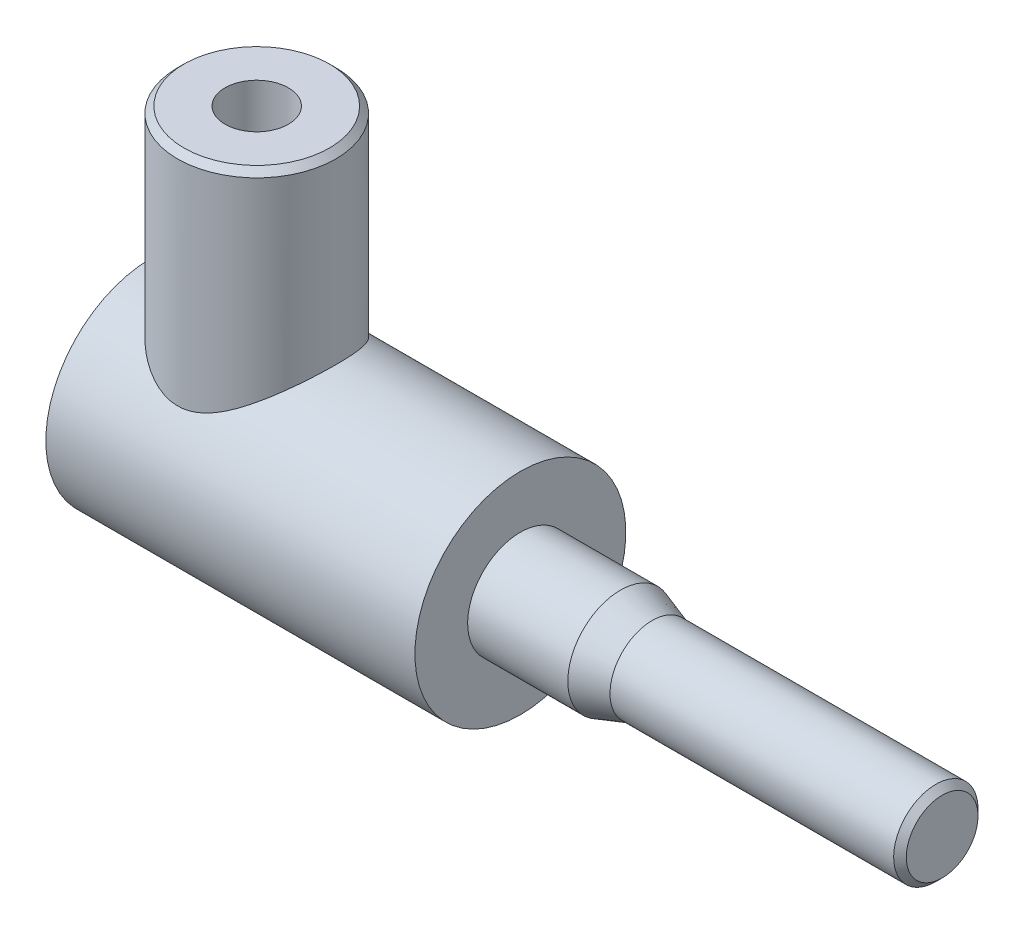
ISO-10303-21;
HEADER;
FILE_DESCRIPTION(('STEP AP214'),'2;1');
FILE_NAME('part.step','',(''),(''),'','','');
FILE_SCHEMA(('AUTOMOTIVE_DESIGN { 1 0 10303 214 1 1 1 1 }'));
ENDSEC;
DATA;
#1=APPLICATION_CONTEXT('core data for automotive mechanical design processes');
#2=APPLICATION_PROTOCOL_DEFINITION('international standard','automotive_design',2000,#1);
#3=PRODUCT_CONTEXT('',#1,'mechanical');
#4=PRODUCT('Part','Part','',(#3));
#5=PRODUCT_RELATED_PRODUCT_CATEGORY('part','',(#4));
#6=PRODUCT_DEFINITION_FORMATION('','',#4);
#7=PRODUCT_DEFINITION_CONTEXT('part definition',#1,'design');
#8=PRODUCT_DEFINITION('design','',#6,#7);
#9=PRODUCT_DEFINITION_SHAPE('','',#8);
#10=(LENGTH_UNIT() NAMED_UNIT(*) SI_UNIT(.MILLI.,.METRE.));
#11=(NAMED_UNIT(*) PLANE_ANGLE_UNIT() SI_UNIT($,.RADIAN.));
#12=(NAMED_UNIT(*) SI_UNIT($,.STERADIAN.) SOLID_ANGLE_UNIT());
#13=UNCERTAINTY_MEASURE_WITH_UNIT(LENGTH_MEASURE(1.E-05),#10,'distance_accuracy_value','');
#14=(GEOMETRIC_REPRESENTATION_CONTEXT(3) GLOBAL_UNCERTAINTY_ASSIGNED_CONTEXT((#13)) GLOBAL_UNIT_ASSIGNED_CONTEXT((#10,
#11,#12)) REPRESENTATION_CONTEXT('',''));
#15=CARTESIAN_POINT('',(0.,0.,0.));
#16=DIRECTION('',(0.,0.,1.));
#17=DIRECTION('',(1.,0.,0.));
#18=AXIS2_PLACEMENT_3D('',#15,#16,#17);
#19=CARTESIAN_POINT('',(0.,0.,0.));
#20=DIRECTION('',(-1.,0.,0.));
#21=DIRECTION('',(0.,-1.,0.));
#22=AXIS2_PLACEMENT_3D('',#19,#20,#21);
#23=CYLINDRICAL_SURFACE('',#22,10.);
#24=CARTESIAN_POINT('',(35.,0.,0.));
#25=DIRECTION('',(-1.,0.,0.));
#26=DIRECTION('',(0.,-1.,0.));
#27=AXIS2_PLACEMENT_3D('',#24,#25,#26);
#28=CIRCLE('',#27,10.);
#29=CARTESIAN_POINT('',(35.,-9.99999999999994,0.));
#30=VERTEX_POINT('',#29);
#31=EDGE_CURVE('E80',#30,#30,#28,.T.);
#32=ORIENTED_EDGE('',*,*,#31,.T.);
#33=EDGE_LOOP('',(#32));
#34=FACE_BOUND('',#33,.T.);
#35=CARTESIAN_POINT('',(0.,0.,0.));
#36=DIRECTION('',(-1.,0.,0.));
#37=DIRECTION('',(0.,-1.,0.));
#38=AXIS2_PLACEMENT_3D('',#35,#36,#37);
#39=CIRCLE('',#38,10.);
#40=CARTESIAN_POINT('',(0.,-10.,0.));
#41=VERTEX_POINT('',#40);
#42=EDGE_CURVE('E84',#41,#41,#39,.T.);
#43=ORIENTED_EDGE('',*,*,#42,.F.);
#44=EDGE_LOOP('',(#43));
#45=FACE_BOUND('',#44,.T.);
#46=CARTESIAN_POINT('',(10.,6.61437827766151,-7.5));
#47=CARTESIAN_POINT('',(9.82495725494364,6.61438197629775,-7.49999838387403));
#48=CARTESIAN_POINT('',(9.64988085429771,6.62136678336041,-7.4938544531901));
#49=CARTESIAN_POINT('',(9.30162914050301,6.64887553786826,-7.4694563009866));
#50=CARTESIAN_POINT('',(9.12845448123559,6.66940400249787,-7.4511980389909));
#51=CARTESIAN_POINT('',(8.78531073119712,6.72284656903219,-7.40301431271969));
#52=CARTESIAN_POINT('',(8.61534958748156,6.75578799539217,-7.37306310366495));
#53=CARTESIAN_POINT('',(8.28013722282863,6.83236869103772,-7.30215402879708));
#54=CARTESIAN_POINT('',(8.11488890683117,6.87601440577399,-7.26118953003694));
#55=CARTESIAN_POINT('',(7.79228438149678,6.9714122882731,-7.16963772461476));
#56=CARTESIAN_POINT('',(7.63484886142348,7.02303888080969,-7.1191972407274));
#57=CARTESIAN_POINT('',(7.32580706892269,7.13305481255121,-7.00896652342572));
#58=CARTESIAN_POINT('',(7.17420014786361,7.19144339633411,-6.94917733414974));
#59=CARTESIAN_POINT('',(6.7283912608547,7.3742648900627,-6.75658060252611));
#60=CARTESIAN_POINT('',(6.44295611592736,7.50643092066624,-6.61047289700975));
#61=CARTESIAN_POINT('',(6.00458918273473,7.72612312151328,-6.35008921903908));
#62=CARTESIAN_POINT('',(5.84384683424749,7.81066517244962,-6.24603009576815));
#63=CARTESIAN_POINT('',(5.53128096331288,7.98137144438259,-6.0263608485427));
#64=CARTESIAN_POINT('',(5.37945817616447,8.0675357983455,-5.9107497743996));
#65=CARTESIAN_POINT('',(5.08479895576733,8.23983652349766,-5.66809334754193));
#66=CARTESIAN_POINT('',(4.94197581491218,8.32597267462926,-5.54103172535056));
#67=CARTESIAN_POINT('',(4.6659155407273,8.49650996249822,-5.27581060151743));
#68=CARTESIAN_POINT('',(4.53267844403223,8.58091109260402,-5.13765105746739));
#69=CARTESIAN_POINT('',(4.25007530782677,8.76343118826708,-4.82101034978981));
#70=CARTESIAN_POINT('',(4.1029859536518,8.86082412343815,-4.64006256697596));
#71=CARTESIAN_POINT('',(3.82471816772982,9.04840053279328,-4.26272756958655));
#72=CARTESIAN_POINT('',(3.69354331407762,9.13858238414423,-4.06633689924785));
#73=CARTESIAN_POINT('',(3.44896890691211,9.30904597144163,-3.65927040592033));
#74=CARTESIAN_POINT('',(3.33553588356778,9.38934628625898,-3.44862258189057));
#75=CARTESIAN_POINT('',(3.12803020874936,9.53775182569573,-3.01395872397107));
#76=CARTESIAN_POINT('',(3.03394731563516,9.60586349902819,-2.78994984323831));
#77=CARTESIAN_POINT('',(2.89223966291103,9.70920590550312,-2.39977112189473));
#78=CARTESIAN_POINT('',(2.83916237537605,9.74815694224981,-2.23654263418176));
#79=CARTESIAN_POINT('',(2.74400039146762,9.81827338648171,-1.90529321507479));
#80=CARTESIAN_POINT('',(2.70191306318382,9.84944065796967,-1.73727344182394));
#81=CARTESIAN_POINT('',(2.62931195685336,9.90335558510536,-1.39753765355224));
#82=CARTESIAN_POINT('',(2.59879045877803,9.92610885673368,-1.225824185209));
#83=CARTESIAN_POINT('',(2.54972531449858,9.96274691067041,-0.879743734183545));
#84=CARTESIAN_POINT('',(2.53118209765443,9.97663137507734,-0.705376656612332));
#85=CARTESIAN_POINT('',(2.50633215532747,9.99524834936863,-0.354821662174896));
#86=CARTESIAN_POINT('',(2.50005762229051,9.99995678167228,-0.178630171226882));
#87=CARTESIAN_POINT('',(2.49994316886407,10.000042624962,0.17375835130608));
#88=CARTESIAN_POINT('',(2.50610319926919,9.99542007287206,0.349955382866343));
#89=CARTESIAN_POINT('',(2.53076094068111,9.97694670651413,0.701027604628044));
#90=CARTESIAN_POINT('',(2.54926109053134,9.96309406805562,0.875902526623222));
#91=CARTESIAN_POINT('',(2.59831081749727,9.9264665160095,1.22299713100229));
#92=CARTESIAN_POINT('',(2.6288603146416,9.90369166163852,1.39521683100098));
#93=CARTESIAN_POINT('',(2.70030459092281,9.8506344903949,1.72994463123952));
#94=CARTESIAN_POINT('',(2.74080528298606,9.82063888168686,1.89258265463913));
#95=CARTESIAN_POINT('',(2.83210989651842,9.75334324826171,2.21341583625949));
#96=CARTESIAN_POINT('',(2.88291740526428,9.71604068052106,2.37160942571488));
#97=CARTESIAN_POINT('',(3.04993725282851,9.59413977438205,2.83823794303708));
#98=CARTESIAN_POINT('',(3.18079963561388,9.49950846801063,3.13896269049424));
#99=CARTESIAN_POINT('',(3.49265612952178,9.27804864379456,3.74612986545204));
#100=CARTESIAN_POINT('',(3.67754413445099,9.1488433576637,4.04966571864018));
#101=CARTESIAN_POINT('',(4.08368488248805,8.87301878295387,4.62284746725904));
#102=CARTESIAN_POINT('',(4.3049686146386,8.7263846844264,4.89246413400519));
#103=CARTESIAN_POINT('',(4.68418588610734,8.48504273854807,5.29480881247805));
#104=CARTESIAN_POINT('',(4.83190914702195,8.3931092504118,5.43905294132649));
#105=CARTESIAN_POINT('',(5.13833857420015,8.20797296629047,5.71460427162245));
#106=CARTESIAN_POINT('',(5.29704685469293,8.11476992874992,5.84590897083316));
#107=CARTESIAN_POINT('',(5.62510296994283,7.92914991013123,6.09530688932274));
#108=CARTESIAN_POINT('',(5.79445638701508,7.83673337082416,6.21339308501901));
#109=CARTESIAN_POINT('',(6.1435255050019,7.65507530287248,6.43587029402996));
#110=CARTESIAN_POINT('',(6.32323887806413,7.56583306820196,6.54026436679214));
#111=CARTESIAN_POINT('',(6.65646947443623,7.41026277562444,6.71557226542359));
#112=CARTESIAN_POINT('',(6.80816268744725,7.34288681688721,6.78902852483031));
#113=CARTESIAN_POINT('',(7.11817133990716,7.21353507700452,6.92631258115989));
#114=CARTESIAN_POINT('',(7.2764888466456,7.15156100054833,6.99013734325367));
#115=CARTESIAN_POINT('',(7.59921893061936,7.03499498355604,7.10743795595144));
#116=CARTESIAN_POINT('',(7.76362007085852,6.98039000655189,7.16093215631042));
#117=CARTESIAN_POINT('',(8.09826601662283,6.88048971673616,7.25697383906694));
#118=CARTESIAN_POINT('',(8.26850653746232,6.83518774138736,7.29952916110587));
#119=CARTESIAN_POINT('',(8.57989342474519,6.76376361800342,7.36568941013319));
#120=CARTESIAN_POINT('',(8.72013435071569,6.73562014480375,7.39137773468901));
#121=CARTESIAN_POINT('',(9.00318788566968,6.68761574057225,7.43484020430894));
#122=CARTESIAN_POINT('',(9.14599918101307,6.66775069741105,7.45261827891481));
#123=CARTESIAN_POINT('',(9.43325219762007,6.63708025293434,7.47994591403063));
#124=CARTESIAN_POINT('',(9.57769233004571,6.62626668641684,7.48950289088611));
#125=CARTESIAN_POINT('',(9.86728908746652,6.6141277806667,7.50022540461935));
#126=CARTESIAN_POINT('',(10.0124457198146,6.61280253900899,7.5013908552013));
#127=CARTESIAN_POINT('',(10.3023994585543,6.61970015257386,7.49530453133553));
#128=CARTESIAN_POINT('',(10.447196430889,6.62792615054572,7.4880499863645));
#129=CARTESIAN_POINT('',(10.7353043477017,6.65357632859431,7.46526710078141));
#130=CARTESIAN_POINT('',(10.8786152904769,6.67100051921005,7.44973875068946));
#131=CARTESIAN_POINT('',(11.1630045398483,6.71437252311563,7.4106713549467));
#132=CARTESIAN_POINT('',(11.3040798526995,6.74033089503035,7.3871223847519));
#133=CARTESIAN_POINT('',(11.5831713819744,6.79983969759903,7.33238101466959));
#134=CARTESIAN_POINT('',(11.7211857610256,6.8333945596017,7.30118415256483));
#135=CARTESIAN_POINT('',(12.0445332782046,6.92081343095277,7.21853070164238));
#136=CARTESIAN_POINT('',(12.2282653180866,6.97758010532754,7.16386030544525));
#137=CARTESIAN_POINT('',(12.5881690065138,7.10070244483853,7.04184138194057));
#138=CARTESIAN_POINT('',(12.7643369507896,7.16706274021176,6.97448672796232));
#139=CARTESIAN_POINT('',(13.1089769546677,7.30690755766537,6.82783857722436));
#140=CARTESIAN_POINT('',(13.2774382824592,7.38040159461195,6.74852905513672));
#141=CARTESIAN_POINT('',(13.6062822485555,7.53219738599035,6.57867589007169));
#142=CARTESIAN_POINT('',(13.7666656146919,7.61049870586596,6.48813326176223));
#143=CARTESIAN_POINT('',(14.0848415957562,7.77280857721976,6.29286343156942));
#144=CARTESIAN_POINT('',(14.2423426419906,7.85692102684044,6.18774819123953));
#145=CARTESIAN_POINT('',(14.548579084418,8.02641315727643,5.96625095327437));
#146=CARTESIAN_POINT('',(14.6973114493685,8.11179326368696,5.84986509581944));
#147=CARTESIAN_POINT('',(14.9857693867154,8.2821707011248,5.6060480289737));
#148=CARTESIAN_POINT('',(15.1254920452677,8.36716790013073,5.47861327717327));
#149=CARTESIAN_POINT('',(15.3954907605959,8.53523072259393,5.21292172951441));
#150=CARTESIAN_POINT('',(15.5257667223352,8.61829632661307,5.07466482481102));
#151=CARTESIAN_POINT('',(15.8037464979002,8.79886280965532,4.75609627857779));
#152=CARTESIAN_POINT('',(15.9490352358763,8.89555017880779,4.57319795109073));
#153=CARTESIAN_POINT('',(16.2235136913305,9.08140583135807,4.19202039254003));
#154=CARTESIAN_POINT('',(16.3526997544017,9.17057240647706,3.99373768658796));
#155=CARTESIAN_POINT('',(16.5930997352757,9.33871511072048,3.58295524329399));
#156=CARTESIAN_POINT('',(16.7043439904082,9.41770839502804,3.37048038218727));
#157=CARTESIAN_POINT('',(16.9072145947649,9.56319061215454,2.93233430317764));
#158=CARTESIAN_POINT('',(16.9988515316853,9.62968629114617,2.70667029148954));
#159=CARTESIAN_POINT('',(17.1359468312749,9.72986513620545,2.31458682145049));
#160=CARTESIAN_POINT('',(17.1869683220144,9.76737290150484,2.15106438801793));
#161=CARTESIAN_POINT('',(17.2779976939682,9.83454643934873,1.81942149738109));
#162=CARTESIAN_POINT('',(17.3180082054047,9.86421408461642,1.65130214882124));
#163=CARTESIAN_POINT('',(17.3864570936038,9.91510086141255,1.31158500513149));
#164=CARTESIAN_POINT('',(17.4149035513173,9.93632589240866,1.13998972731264));
#165=CARTESIAN_POINT('',(17.4598488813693,9.96991081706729,0.794368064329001));
#166=CARTESIAN_POINT('',(17.4763473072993,9.98227037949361,0.620341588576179));
#167=CARTESIAN_POINT('',(17.4971619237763,9.99786922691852,0.270737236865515));
#168=CARTESIAN_POINT('',(17.5014492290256,10.0010868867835,0.0951566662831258));
#169=CARTESIAN_POINT('',(17.4976905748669,9.99826797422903,-0.255796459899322));
#170=CARTESIAN_POINT('',(17.4896446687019,9.99223144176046,-0.431169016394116));
#171=CARTESIAN_POINT('',(17.4613448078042,9.9710369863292,-0.780405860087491));
#172=CARTESIAN_POINT('',(17.4410880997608,9.95587700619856,-0.954269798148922));
#173=CARTESIAN_POINT('',(17.3886777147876,9.91676635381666,-1.29918219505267));
#174=CARTESIAN_POINT('',(17.3565240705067,9.89281570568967,-1.47023066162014));
#175=CARTESIAN_POINT('',(17.2818930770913,9.83744673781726,-1.80341707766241));
#176=CARTESIAN_POINT('',(17.2397463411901,9.80626816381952,-1.96566921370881));
#177=CARTESIAN_POINT('',(17.1452030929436,9.7366786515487,-2.28559292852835));
#178=CARTESIAN_POINT('',(17.0928030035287,9.69826518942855,-2.44326288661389));
#179=CARTESIAN_POINT('',(16.9211022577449,9.5731629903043,-2.90814334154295));
#180=CARTESIAN_POINT('',(16.787246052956,9.47657095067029,-3.20746548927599));
#181=CARTESIAN_POINT('',(16.4686016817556,9.2508781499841,-3.81278372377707));
#182=CARTESIAN_POINT('',(16.2797616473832,9.11933431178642,-4.11569486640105));
#183=CARTESIAN_POINT('',(15.8656514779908,8.83925861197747,-4.68708538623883));
#184=CARTESIAN_POINT('',(15.6403478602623,8.69071117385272,-4.95553270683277));
#185=CARTESIAN_POINT('',(15.2544765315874,8.44671829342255,-5.3557329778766));
#186=CARTESIAN_POINT('',(15.1041460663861,8.35384690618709,-5.49915593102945));
#187=CARTESIAN_POINT('',(14.7924136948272,8.16710630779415,-5.77284943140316));
#188=CARTESIAN_POINT('',(14.6310095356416,8.07323689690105,-5.90311728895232));
#189=CARTESIAN_POINT('',(14.2974657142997,7.88663999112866,-6.15019469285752));
#190=CARTESIAN_POINT('',(14.1253212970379,7.79391302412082,-6.26699821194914));
#191=CARTESIAN_POINT('',(13.7705492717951,7.61208490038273,-6.48663766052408));
#192=CARTESIAN_POINT('',(13.5879243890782,7.52298281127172,-6.58947719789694));
#193=CARTESIAN_POINT('',(13.252864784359,7.36980342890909,-6.75989283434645));
#194=CARTESIAN_POINT('',(13.1024308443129,7.30447828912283,-6.83028750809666));
#195=CARTESIAN_POINT('',(12.7951976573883,7.1793755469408,-6.96166587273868));
#196=CARTESIAN_POINT('',(12.6383969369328,7.11959923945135,-7.02264736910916));
#197=CARTESIAN_POINT('',(12.3190246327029,7.00753877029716,-7.13446998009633));
#198=CARTESIAN_POINT('',(12.1564671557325,6.95523768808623,-7.18533410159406));
#199=CARTESIAN_POINT('',(11.8258231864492,6.85992197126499,-7.27638652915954));
#200=CARTESIAN_POINT('',(11.6577391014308,6.81690335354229,-7.31657941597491));
#201=CARTESIAN_POINT('',(11.2461176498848,6.72665035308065,-7.39982855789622));
#202=CARTESIAN_POINT('',(11.0000862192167,6.68501161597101,-7.43721258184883));
#203=CARTESIAN_POINT('',(10.6271090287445,6.6428821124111,-7.47478587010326));
#204=CARTESIAN_POINT('',(10.5021205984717,6.63222701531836,-7.48422651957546));
#205=CARTESIAN_POINT('',(10.2514271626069,6.61797427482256,-7.49683371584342));
#206=CARTESIAN_POINT('',(10.1257222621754,6.61437562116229,-7.50000116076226));
#207=CARTESIAN_POINT('',(10.,6.61437827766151,-7.5));
#208=B_SPLINE_CURVE_WITH_KNOTS('',3,(#46,#47,#48,#49,#50,#51,#52,#53,#54,#55,#56,#57,#58,#59,
#60,#61,#62,#63,#64,#65,#66,#67,#68,#69,#70,#71,#72,#73,#74,#75,#76,#77,#78,#79,#80,#81,#82,#83,
#84,#85,#86,#87,#88,#89,#90,#91,#92,#93,#94,#95,#96,#97,#98,#99,#100,#101,#102,#103,#104,#105,
#106,#107,#108,#109,#110,#111,#112,#113,#114,#115,#116,#117,#118,#119,#120,#121,#122,#123,#124,
#125,#126,#127,#128,#129,#130,#131,#132,#133,#134,#135,#136,#137,#138,#139,#140,#141,#142,#143,
#144,#145,#146,#147,#148,#149,#150,#151,#152,#153,#154,#155,#156,#157,#158,#159,#160,#161,#162,
#163,#164,#165,#166,#167,#168,#169,#170,#171,#172,#173,#174,#175,#176,#177,#178,#179,#180,#181,
#182,#183,#184,#185,#186,#187,#188,#189,#190,#191,#192,#193,#194,#195,#196,#197,#198,#199,#200,
#201,#202,#203,#204,#205,#206,#207),.UNSPECIFIED.,.T.,.F.,(4,2,2,2,2,2,2,2,2,2,2,2,2,2,2,2,2,2,
2,2,2,2,2,2,2,2,2,2,2,2,2,2,2,2,2,2,2,2,2,2,2,2,2,2,2,2,2,2,2,2,2,2,2,2,2,2,2,2,2,2,2,2,2,2,2,2,
2,2,2,2,2,2,2,2,2,2,2,2,2,2,4),(0.,0.524946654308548,1.05006848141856,1.57635306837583,
2.10295533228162,2.62198622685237,3.14095919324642,4.17811218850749,4.80566508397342,
5.43326964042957,6.06178042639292,6.69029361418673,7.44738762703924,8.20465154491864,
8.96046919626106,9.71588577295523,10.2433789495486,10.7707456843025,11.297759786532,
11.8247927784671,12.3532068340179,12.8816187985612,13.4101352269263,13.9386481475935,
14.4488928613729,14.9593154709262,15.9794159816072,17.1099698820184,18.2414914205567,
18.9189650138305,19.5965693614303,20.2745320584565,20.952343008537,21.49647104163,
22.0407701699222,22.5840934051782,23.127026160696,23.5625720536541,23.997901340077,
24.4328374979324,24.8677781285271,25.3028619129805,25.7379461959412,26.1735708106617,
26.6094502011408,27.2082971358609,27.8074340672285,28.4073813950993,29.0072745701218,
29.6283553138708,30.2496495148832,30.8711436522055,31.4926440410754,32.2499956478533,
33.0075188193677,33.7637473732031,34.5195665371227,35.0451096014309,35.57052701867,
36.0955766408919,36.6206458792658,37.1469561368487,37.6732641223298,38.1996908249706,
38.7261160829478,39.2370944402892,39.7482513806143,40.7698210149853,41.9071133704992,
43.0454560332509,43.7276445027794,44.4099721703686,45.0926041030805,45.7750593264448,
46.3100858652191,46.8452369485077,47.3791568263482,47.9128471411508,48.6669364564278,
49.044026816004,49.4210631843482),.UNSPECIFIED.);
#209=CARTESIAN_POINT('',(10.,6.61437827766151,-7.5));
#210=VERTEX_POINT('',#209);
#211=EDGE_CURVE('E25',#210,#210,#208,.T.);
#212=ORIENTED_EDGE('',*,*,#211,.F.);
#213=EDGE_LOOP('',(#212));
#214=FACE_BOUND('',#213,.T.);
#215=ADVANCED_FACE('F14',(#34,#45,#214),#23,.T.);
#216=CARTESIAN_POINT('',(0.,0.,0.));
#217=DIRECTION('',(1.,0.,0.));
#218=DIRECTION('',(0.,1.,0.));
#219=AXIS2_PLACEMENT_3D('',#216,#217,#218);
#220=PLANE('',#219);
#221=ORIENTED_EDGE('',*,*,#42,.T.);
#222=EDGE_LOOP('',(#221));
#223=FACE_BOUND('',#222,.T.);
#224=ADVANCED_FACE('F16',(#223),#220,.F.);
#225=CARTESIAN_POINT('',(35.,10.,1.11022302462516E-13));
#226=DIRECTION('',(-1.,0.,0.));
#227=DIRECTION('',(0.,-1.,0.));
#228=AXIS2_PLACEMENT_3D('',#225,#226,#227);
#229=PLANE('',#228);
#230=ORIENTED_EDGE('',*,*,#31,.F.);
#231=EDGE_LOOP('',(#230));
#232=FACE_BOUND('',#231,.T.);
#233=CARTESIAN_POINT('',(35.,0.,0.));
#234=DIRECTION('',(-1.,0.,0.));
#235=DIRECTION('',(0.,-1.,0.));
#236=AXIS2_PLACEMENT_3D('',#233,#234,#235);
#237=CIRCLE('',#236,5.);
#238=CARTESIAN_POINT('',(35.,-4.99999999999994,0.));
#239=VERTEX_POINT('',#238);
#240=EDGE_CURVE('E90',#239,#239,#237,.T.);
#241=ORIENTED_EDGE('',*,*,#240,.T.);
#242=EDGE_LOOP('',(#241));
#243=FACE_BOUND('',#242,.T.);
#244=ADVANCED_FACE('F63',(#232,#243),#229,.F.);
#245=CARTESIAN_POINT('',(0.,0.,0.));
#246=DIRECTION('',(-1.,0.,0.));
#247=DIRECTION('',(0.,-1.,0.));
#248=AXIS2_PLACEMENT_3D('',#245,#246,#247);
#249=CYLINDRICAL_SURFACE('',#248,5.);
#250=ORIENTED_EDGE('',*,*,#240,.F.);
#251=EDGE_LOOP('',(#250));
#252=FACE_BOUND('',#251,.T.);
#253=CARTESIAN_POINT('',(44.5,0.,1.11022302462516E-13));
#254=DIRECTION('',(-1.,0.,0.));
#255=DIRECTION('',(0.,-1.,0.));
#256=AXIS2_PLACEMENT_3D('',#253,#254,#255);
#257=CIRCLE('',#256,5.);
#258=CARTESIAN_POINT('',(44.5,-4.99999999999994,1.10883524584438E-13));
#259=VERTEX_POINT('',#258);
#260=EDGE_CURVE('E95',#259,#259,#257,.T.);
#261=ORIENTED_EDGE('',*,*,#260,.T.);
#262=EDGE_LOOP('',(#261));
#263=FACE_BOUND('',#262,.T.);
#264=ADVANCED_FACE('F60',(#252,#263),#249,.T.);
#265=CARTESIAN_POINT('',(47.5,0.,0.));
#266=DIRECTION('',(-1.,0.,0.));
#267=DIRECTION('',(0.,-1.,0.));
#268=AXIS2_PLACEMENT_3D('',#265,#266,#267);
#269=CONICAL_SURFACE('',#268,4.,0.321750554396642);
#270=ORIENTED_EDGE('',*,*,#260,.F.);
#271=EDGE_LOOP('',(#270));
#272=FACE_BOUND('',#271,.T.);
#273=CARTESIAN_POINT('',(47.5,0.,0.));
#274=DIRECTION('',(-1.,0.,0.));
#275=DIRECTION('',(0.,-1.,0.));
#276=AXIS2_PLACEMENT_3D('',#273,#274,#275);
#277=CIRCLE('',#276,4.);
#278=CARTESIAN_POINT('',(47.5,-4.,0.));
#279=VERTEX_POINT('',#278);
#280=EDGE_CURVE('E98',#279,#279,#277,.T.);
#281=ORIENTED_EDGE('',*,*,#280,.T.);
#282=EDGE_LOOP('',(#281));
#283=FACE_BOUND('',#282,.T.);
#284=ADVANCED_FACE('F56',(#272,#283),#269,.T.);
#285=CARTESIAN_POINT('',(0.,0.,0.));
#286=DIRECTION('',(-1.,0.,0.));
#287=DIRECTION('',(0.,-1.,0.));
#288=AXIS2_PLACEMENT_3D('',#285,#286,#287);
#289=CYLINDRICAL_SURFACE('',#288,4.);
#290=CARTESIAN_POINT('',(74.4,0.,1.11022302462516E-13));
#291=DIRECTION('',(-1.,0.,0.));
#292=DIRECTION('',(0.,-1.,0.));
#293=AXIS2_PLACEMENT_3D('',#290,#291,#292);
#294=CIRCLE('',#293,4.);
#295=CARTESIAN_POINT('',(74.4,-4.,1.10911280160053E-13));
#296=VERTEX_POINT('',#295);
#297=EDGE_CURVE('E87',#296,#296,#294,.T.);
#298=ORIENTED_EDGE('',*,*,#297,.T.);
#299=EDGE_LOOP('',(#298));
#300=FACE_BOUND('',#299,.T.);
#301=ORIENTED_EDGE('',*,*,#280,.F.);
#302=EDGE_LOOP('',(#301));
#303=FACE_BOUND('',#302,.T.);
#304=ADVANCED_FACE('F52',(#300,#303),#289,.T.);
#305=CARTESIAN_POINT('',(75.,4.,0.));
#306=DIRECTION('',(-1.,0.,0.));
#307=DIRECTION('',(0.,-1.,0.));
#308=AXIS2_PLACEMENT_3D('',#305,#306,#307);
#309=PLANE('',#308);
#310=CARTESIAN_POINT('',(75.,0.,1.11022302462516E-13));
#311=DIRECTION('',(-1.,0.,0.));
#312=DIRECTION('',(0.,-1.,0.));
#313=AXIS2_PLACEMENT_3D('',#310,#311,#312);
#314=CIRCLE('',#313,3.4);
#315=CARTESIAN_POINT('',(75.,-3.4,1.10927933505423E-13));
#316=VERTEX_POINT('',#315);
#317=EDGE_CURVE('E29',#316,#316,#314,.F.);
#318=ORIENTED_EDGE('',*,*,#317,.T.);
#319=EDGE_LOOP('',(#318));
#320=FACE_BOUND('',#319,.T.);
#321=ADVANCED_FACE('F48',(#320),#309,.F.);
#322=CARTESIAN_POINT('',(74.4,0.,1.11022302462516E-13));
#323=DIRECTION('',(-1.,0.,0.));
#324=DIRECTION('',(0.,-1.,0.));
#325=AXIS2_PLACEMENT_3D('',#322,#323,#324);
#326=CONICAL_SURFACE('',#325,4.,0.785398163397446);
#327=ORIENTED_EDGE('',*,*,#317,.F.);
#328=EDGE_LOOP('',(#327));
#329=FACE_BOUND('',#328,.T.);
#330=ORIENTED_EDGE('',*,*,#297,.F.);
#331=EDGE_LOOP('',(#330));
#332=FACE_BOUND('',#331,.T.);
#333=ADVANCED_FACE('F44',(#329,#332),#326,.T.);
#334=CARTESIAN_POINT('',(10.0000000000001,27.5,0.));
#335=DIRECTION('',(0.,-1.,0.));
#336=DIRECTION('',(0.,0.,-1.));
#337=AXIS2_PLACEMENT_3D('',#334,#335,#336);
#338=CYLINDRICAL_SURFACE('',#337,7.5);
#339=CARTESIAN_POINT('',(10.0000000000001,26.9,0.));
#340=DIRECTION('',(0.,1.,0.));
#341=DIRECTION('',(0.,0.,1.));
#342=AXIS2_PLACEMENT_3D('',#339,#340,#341);
#343=CIRCLE('',#342,7.5);
#344=CARTESIAN_POINT('',(10.0000000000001,26.9,7.5));
#345=VERTEX_POINT('',#344);
#346=EDGE_CURVE('E10',#345,#345,#343,.F.);
#347=ORIENTED_EDGE('',*,*,#346,.T.);
#348=EDGE_LOOP('',(#347));
#349=FACE_BOUND('',#348,.T.);
#350=ORIENTED_EDGE('',*,*,#211,.T.);
#351=EDGE_LOOP('',(#350));
#352=FACE_BOUND('',#351,.T.);
#353=ADVANCED_FACE('F38',(#349,#352),#338,.T.);
#354=CARTESIAN_POINT('',(10.0000000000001,27.5,0.));
#355=DIRECTION('',(0.,1.,0.));
#356=DIRECTION('',(0.,0.,1.));
#357=AXIS2_PLACEMENT_3D('',#354,#355,#356);
#358=PLANE('',#357);
#359=CARTESIAN_POINT('',(10.0000000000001,27.5,0.));
#360=DIRECTION('',(0.,1.,0.));
#361=DIRECTION('',(0.,0.,1.));
#362=AXIS2_PLACEMENT_3D('',#359,#360,#361);
#363=CIRCLE('',#362,3.);
#364=CARTESIAN_POINT('',(10.0000000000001,27.5,3.));
#365=VERTEX_POINT('',#364);
#366=EDGE_CURVE('E104',#365,#365,#363,.T.);
#367=ORIENTED_EDGE('',*,*,#366,.F.);
#368=EDGE_LOOP('',(#367));
#369=FACE_BOUND('',#368,.T.);
#370=CARTESIAN_POINT('',(10.0000000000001,27.5,0.));
#371=DIRECTION('',(0.,1.,0.));
#372=DIRECTION('',(0.,0.,1.));
#373=AXIS2_PLACEMENT_3D('',#370,#371,#372);
#374=CIRCLE('',#373,6.9);
#375=CARTESIAN_POINT('',(10.0000000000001,27.5,6.9));
#376=VERTEX_POINT('',#375);
#377=EDGE_CURVE('E21',#376,#376,#374,.T.);
#378=ORIENTED_EDGE('',*,*,#377,.T.);
#379=EDGE_LOOP('',(#378));
#380=FACE_BOUND('',#379,.T.);
#381=ADVANCED_FACE('F43',(#369,#380),#358,.T.);
#382=CARTESIAN_POINT('',(10.0000000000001,27.5,0.));
#383=DIRECTION('',(0.,-1.,0.));
#384=DIRECTION('',(0.,0.,-1.));
#385=AXIS2_PLACEMENT_3D('',#382,#383,#384);
#386=CONICAL_SURFACE('',#385,6.9,0.785398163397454);
#387=ORIENTED_EDGE('',*,*,#346,.F.);
#388=EDGE_LOOP('',(#387));
#389=FACE_BOUND('',#388,.T.);
#390=ORIENTED_EDGE('',*,*,#377,.F.);
#391=EDGE_LOOP('',(#390));
#392=FACE_BOUND('',#391,.T.);
#393=ADVANCED_FACE('F111',(#389,#392),#386,.T.);
#394=CARTESIAN_POINT('',(10.,0.,0.));
#395=DIRECTION('',(0.,1.,0.));
#396=DIRECTION('',(0.,0.,1.));
#397=AXIS2_PLACEMENT_3D('',#394,#395,#396);
#398=CYLINDRICAL_SURFACE('',#397,3.);
#399=CARTESIAN_POINT('',(10.,0.,0.));
#400=DIRECTION('',(0.,1.,0.));
#401=DIRECTION('',(0.,0.,1.));
#402=AXIS2_PLACEMENT_3D('',#399,#400,#401);
#403=CIRCLE('',#402,3.);
#404=CARTESIAN_POINT('',(10.,0.,3.));
#405=VERTEX_POINT('',#404);
#406=EDGE_CURVE('E101',#405,#405,#403,.T.);
#407=ORIENTED_EDGE('',*,*,#406,.F.);
#408=EDGE_LOOP('',(#407));
#409=FACE_BOUND('',#408,.T.);
#410=ORIENTED_EDGE('',*,*,#366,.T.);
#411=EDGE_LOOP('',(#410));
#412=FACE_BOUND('',#411,.T.);
#413=ADVANCED_FACE('F108',(#409,#412),#398,.F.);
#414=CARTESIAN_POINT('',(10.,0.,0.));
#415=DIRECTION('',(0.,1.,0.));
#416=DIRECTION('',(0.,0.,1.));
#417=AXIS2_PLACEMENT_3D('',#414,#415,#416);
#418=PLANE('',#417);
#419=ORIENTED_EDGE('',*,*,#406,.T.);
#420=EDGE_LOOP('',(#419));
#421=FACE_BOUND('',#420,.T.);
#422=ADVANCED_FACE('F119',(#421),#418,.T.);
#423=CLOSED_SHELL('',(#215,#224,#244,#264,#284,#304,#321,#333,#353,#381,#393,#413,#422));
#424=MANIFOLD_SOLID_BREP('B1',#423);
#425=ADVANCED_BREP_SHAPE_REPRESENTATION('',(#18,#424),#14);
#426=SHAPE_DEFINITION_REPRESENTATION(#9,#425);
ENDSEC;
END-ISO-10303-21;
